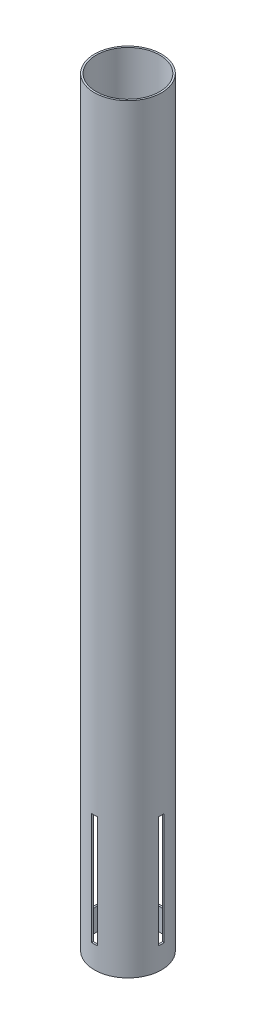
from build123d import *

# Parameters (mm, degrees)
SKETCH1_R           = 38.1
BOSS_EXTRUDE1_DEPTH = 863.6
SHELL1_T            = -2
SKETCH2_W           = 6.5
SKETCH2_H           = 127
CUT_EXTRUDE1_DEPTH  = 863.6
CIRPATTERN1_COUNT   = 2
CIRPATTERN1_ANGLE   = 90


with BuildPart() as part:
    # Sketch1 → Boss-Extrude1 (new body)
    with BuildSketch(Plane(origin=(0, 0, 0), x_dir=(1, 0, 0), z_dir=(0, 1, 0))):
        with Locations(Location((0, 0, 0), (0, 0, 270))):
            Circle(SKETCH1_R)
    extrude(amount=BOSS_EXTRUDE1_DEPTH)

    # Shell1
    shell1_openings = [part.faces().sort_by_distance(p)[0] for p in [
        (0, 863.6, 0),
        (0, 0, 0),
    ]]
    offset(amount=SHELL1_T, openings=shell1_openings, kind=Kind.INTERSECTION)

    # Sketch2 → Cut-Extrude1 (cut, symmetric)
    with BuildSketch(Plane.XY):
        with Locations((0, 88.9)):
            Rectangle(SKETCH2_W, SKETCH2_H)
    cut_extrude1 = extrude(amount=CUT_EXTRUDE1_DEPTH, both=True, mode=Mode.SUBTRACT)

    # CirPattern1: Cut-Extrude1 ×2 about axis
    cirpattern1_axis = Axis((0, 863.6, 0), (0, -1, 0))
    for i in range(1, CIRPATTERN1_COUNT):
        add(cut_extrude1.rotate(cirpattern1_axis, i * CIRPATTERN1_ANGLE / (CIRPATTERN1_COUNT - 1)), mode=Mode.SUBTRACT)


solid = part.part
